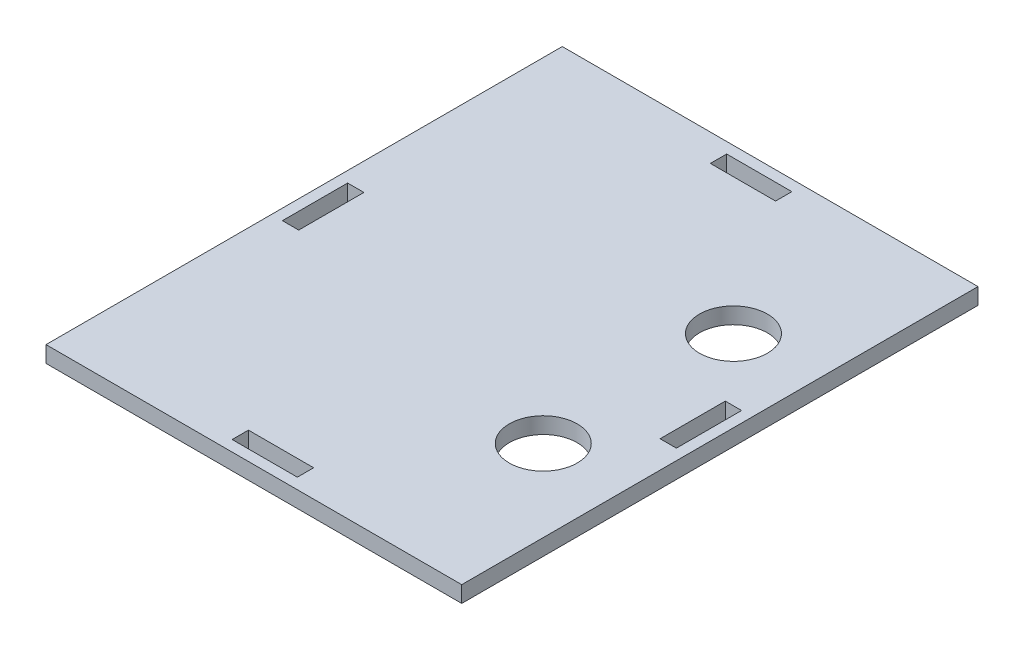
from build123d import *

# Parameters (mm, degrees)
SKETCH1_W           = 72.5
SKETCH1_H           = 2
SKETCH1_W_2         = 2
BOSS_EXTRUDE2_DEPTH = 3
SKETCH2_R           = 6.25
CUT_EXTRUDE1_DEPTH  = 3


with BuildPart() as part:
    # Sketch1 → Boss-Extrude2 (new body)
    with BuildSketch(Plane(origin=(0, 0, 0), x_dir=(1, 0, 0), z_dir=(0, 1, 0))):
        Polygon((-6, 45.5), (-36.25, 45.5), (-36.25, 6), (-33.25, 6), (-33.25, -6), (-36.25, -6), (-36.25, -45.5), (-6, -45.5), (-6, -42.5), (6, -42.5), (6, -45.5), (36.25, -45.5), (36.25, -6), (33.25, -6), (33.25, 6), (36.25, 6), (36.25, 45.5), (6, 45.5), (6, 42.5), (-6, 42.5), align=None)
        Polygon((-36.25, -47.5), (36.25, -47.5), (38.25, -47.5), (38.25, 45.5), (38.25, 47.5), (36.25, 47.5), (36.25, 45.5), (36.25, -45.5), (-36.25, -45.5), align=None)
        Polygon((-36.25, 45.5), (-38.25, 45.5), (-38.25, -47.5), (-36.25, -47.5), (-36.25, -45.5), align=None)
        with Locations((0, 46.5)):
            Rectangle(SKETCH1_W, SKETCH1_H)
        with Locations((-37.25, 46.5)):
            Rectangle(SKETCH1_W_2, SKETCH1_H)
    extrude(amount=BOSS_EXTRUDE2_DEPTH)

    # Sketch2 → Cut-Extrude1 (cut)
    with BuildSketch(Plane(origin=(0, 3, 0), x_dir=(1, 0, 0), z_dir=(0, 1, 0))):
        with Locations(Location((23.25, 17.5, 0), (0, 0, 270))):
            Circle(SKETCH2_R)
        with Locations(Location((23.25, -17.5, 0), (0, 0, 270))):
            Circle(SKETCH2_R)
    extrude(amount=-CUT_EXTRUDE1_DEPTH, mode=Mode.SUBTRACT)


solid = part.part
